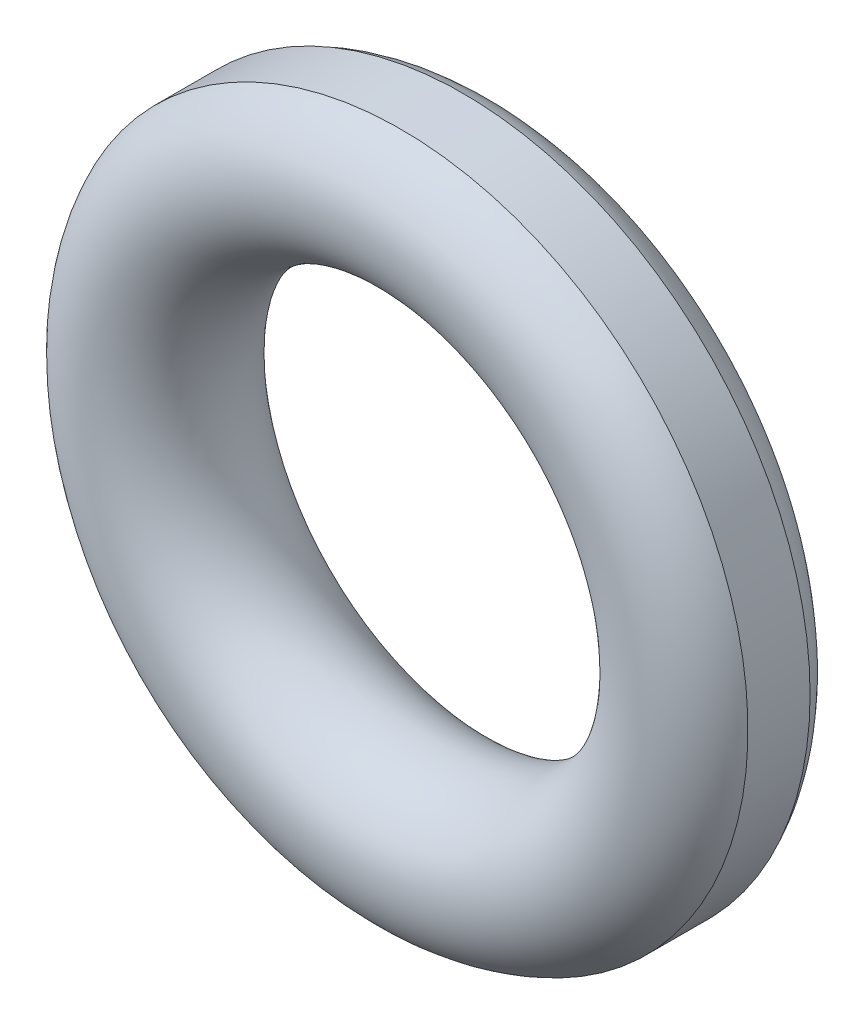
from build123d import *

# Parameters (mm, degrees)
SKETCH2_R               = 1.175
CUT_EXTRUDE1_DEPTH      = 8.726618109
CUT_EXTRUDE1_DEPTH_BACK = 8.726618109
SKETCH3_OUTSIDE_W       = 15.89
SKETCH3_OUTSIDE_H       = 15.89
SKETCH3_OUTSIDE_R       = 5.3


with BuildPart() as part:
    # Base-Sweep: sweep along a path in Sketch1
    with BuildLine(Plane.XY) as base_sweep_path:
        CenterArc((0, 0), 4.3, 0, 360)
    # Sketch2 → Base-Sweep (sweep)
    with BuildSketch(Plane(origin=(0, 0, 0), x_dir=(0, 0, -1), z_dir=(1, 0, 0))):
        with Locations((0, 4.225)):
            Circle(SKETCH2_R)
    sweep(path=base_sweep_path.line)

    # Sketch3 outside → Cut-Extrude1 (cut, two sides: drawn at the far end of the back side and taken through both)
    with BuildSketch(Plane.XY.offset(-CUT_EXTRUDE1_DEPTH_BACK)):
        Rectangle(SKETCH3_OUTSIDE_W, SKETCH3_OUTSIDE_H)
        with Locations(Location((0, 0, 0), (0, 0, 180))):
            Circle(SKETCH3_OUTSIDE_R, mode=Mode.SUBTRACT)
    extrude(amount=CUT_EXTRUDE1_DEPTH + CUT_EXTRUDE1_DEPTH_BACK, mode=Mode.SUBTRACT)


solid = part.part
